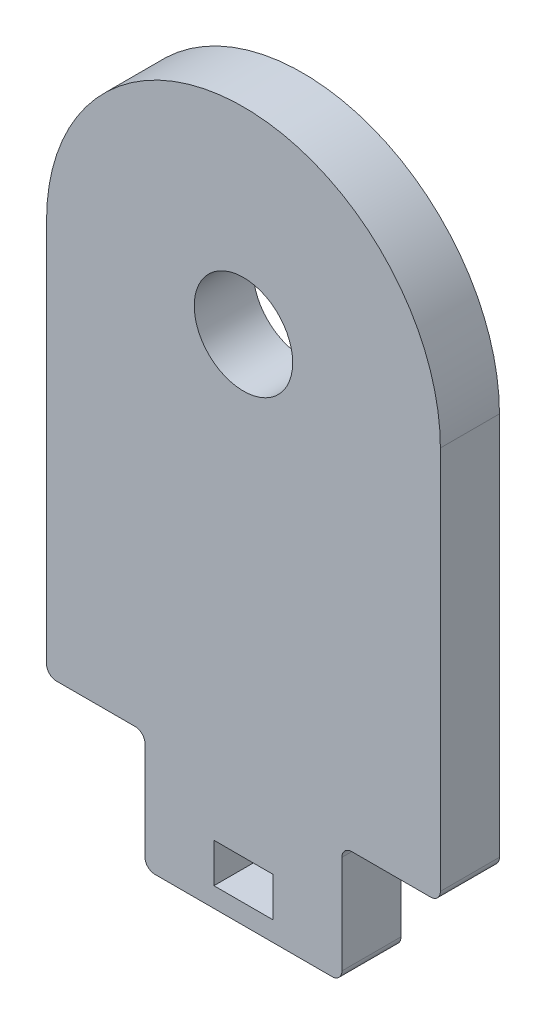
ISO-10303-21;
HEADER;
FILE_DESCRIPTION(('STEP AP214'),'2;1');
FILE_NAME('part.step','',(''),(''),'','','');
FILE_SCHEMA(('AUTOMOTIVE_DESIGN { 1 0 10303 214 1 1 1 1 }'));
ENDSEC;
DATA;
#1=APPLICATION_CONTEXT('core data for automotive mechanical design processes');
#2=APPLICATION_PROTOCOL_DEFINITION('international standard','automotive_design',2000,#1);
#3=PRODUCT_CONTEXT('',#1,'mechanical');
#4=PRODUCT('Part','Part','',(#3));
#5=PRODUCT_RELATED_PRODUCT_CATEGORY('part','',(#4));
#6=PRODUCT_DEFINITION_FORMATION('','',#4);
#7=PRODUCT_DEFINITION_CONTEXT('part definition',#1,'design');
#8=PRODUCT_DEFINITION('design','',#6,#7);
#9=PRODUCT_DEFINITION_SHAPE('','',#8);
#10=(LENGTH_UNIT() NAMED_UNIT(*) SI_UNIT(.MILLI.,.METRE.));
#11=(NAMED_UNIT(*) PLANE_ANGLE_UNIT() SI_UNIT($,.RADIAN.));
#12=(NAMED_UNIT(*) SI_UNIT($,.STERADIAN.) SOLID_ANGLE_UNIT());
#13=UNCERTAINTY_MEASURE_WITH_UNIT(LENGTH_MEASURE(1.E-05),#10,'distance_accuracy_value','');
#14=(GEOMETRIC_REPRESENTATION_CONTEXT(3) GLOBAL_UNCERTAINTY_ASSIGNED_CONTEXT((#13)) GLOBAL_UNIT_ASSIGNED_CONTEXT((#10,
#11,#12)) REPRESENTATION_CONTEXT('',''));
#15=CARTESIAN_POINT('',(0.,0.,0.));
#16=DIRECTION('',(0.,0.,1.));
#17=DIRECTION('',(1.,0.,0.));
#18=AXIS2_PLACEMENT_3D('',#15,#16,#17);
#19=CARTESIAN_POINT('',(0.,52.,6.));
#20=DIRECTION('',(0.,0.,-1.));
#21=DIRECTION('',(-1.,0.,0.));
#22=AXIS2_PLACEMENT_3D('',#19,#20,#21);
#23=PLANE('',#22);
#24=CARTESIAN_POINT('',(0.,52.,6.));
#25=DIRECTION('',(0.,0.,1.));
#26=DIRECTION('',(1.,0.,0.));
#27=AXIS2_PLACEMENT_3D('',#24,#25,#26);
#28=CIRCLE('',#27,5.);
#29=CARTESIAN_POINT('',(5.,52.,6.));
#30=VERTEX_POINT('',#29);
#31=EDGE_CURVE('E545',#30,#30,#28,.T.);
#32=ORIENTED_EDGE('',*,*,#31,.F.);
#33=EDGE_LOOP('',(#32));
#34=FACE_BOUND('',#33,.T.);
#35=DIRECTION('',(0.,-1.,0.));
#36=VECTOR('',#35,1.);
#37=CARTESIAN_POINT('',(-20.,12.,6.));
#38=LINE('',#37,#36);
#39=CARTESIAN_POINT('',(-20.,52.,6.));
#40=VERTEX_POINT('',#39);
#41=CARTESIAN_POINT('',(-20.,13.,6.));
#42=VERTEX_POINT('',#41);
#43=EDGE_CURVE('E220',#40,#42,#38,.T.);
#44=ORIENTED_EDGE('',*,*,#43,.T.);
#45=CARTESIAN_POINT('',(-19.,13.,6.));
#46=DIRECTION('',(0.,0.,-1.));
#47=DIRECTION('',(-1.,0.,0.));
#48=AXIS2_PLACEMENT_3D('',#45,#46,#47);
#49=CIRCLE('',#48,1.);
#50=CARTESIAN_POINT('',(-19.,12.,6.));
#51=VERTEX_POINT('',#50);
#52=EDGE_CURVE('E275',#42,#51,#49,.F.);
#53=ORIENTED_EDGE('',*,*,#52,.T.);
#54=DIRECTION('',(1.,0.,0.));
#55=VECTOR('',#54,1.);
#56=CARTESIAN_POINT('',(-10.,12.,6.));
#57=LINE('',#56,#55);
#58=CARTESIAN_POINT('',(-11.,12.,6.));
#59=VERTEX_POINT('',#58);
#60=EDGE_CURVE('E223',#51,#59,#57,.T.);
#61=ORIENTED_EDGE('',*,*,#60,.T.);
#62=CARTESIAN_POINT('',(-11.,11.,6.));
#63=DIRECTION('',(0.,0.,-1.));
#64=DIRECTION('',(-1.,0.,0.));
#65=AXIS2_PLACEMENT_3D('',#62,#63,#64);
#66=CIRCLE('',#65,1.);
#67=CARTESIAN_POINT('',(-10.,11.,6.));
#68=VERTEX_POINT('',#67);
#69=EDGE_CURVE('E301',#59,#68,#66,.T.);
#70=ORIENTED_EDGE('',*,*,#69,.T.);
#71=DIRECTION('',(0.,-1.,0.));
#72=VECTOR('',#71,1.);
#73=CARTESIAN_POINT('',(-10.,0.,6.));
#74=LINE('',#73,#72);
#75=CARTESIAN_POINT('',(-10.,1.,6.));
#76=VERTEX_POINT('',#75);
#77=EDGE_CURVE('E226',#68,#76,#74,.T.);
#78=ORIENTED_EDGE('',*,*,#77,.T.);
#79=CARTESIAN_POINT('',(-9.,1.,6.));
#80=DIRECTION('',(0.,0.,-1.));
#81=DIRECTION('',(-1.,0.,0.));
#82=AXIS2_PLACEMENT_3D('',#79,#80,#81);
#83=CIRCLE('',#82,1.);
#84=CARTESIAN_POINT('',(-9.,0.,6.));
#85=VERTEX_POINT('',#84);
#86=EDGE_CURVE('E61',#76,#85,#83,.F.);
#87=ORIENTED_EDGE('',*,*,#86,.T.);
#88=DIRECTION('',(1.,0.,0.));
#89=VECTOR('',#88,1.);
#90=CARTESIAN_POINT('',(-10.,0.,6.));
#91=LINE('',#90,#89);
#92=CARTESIAN_POINT('',(9.,0.,6.));
#93=VERTEX_POINT('',#92);
#94=EDGE_CURVE('E228',#85,#93,#91,.T.);
#95=ORIENTED_EDGE('',*,*,#94,.T.);
#96=CARTESIAN_POINT('',(9.,1.,6.));
#97=DIRECTION('',(0.,0.,-1.));
#98=DIRECTION('',(-1.,0.,0.));
#99=AXIS2_PLACEMENT_3D('',#96,#97,#98);
#100=CIRCLE('',#99,1.);
#101=CARTESIAN_POINT('',(10.,1.,6.));
#102=VERTEX_POINT('',#101);
#103=EDGE_CURVE('E270',#93,#102,#100,.F.);
#104=ORIENTED_EDGE('',*,*,#103,.T.);
#105=DIRECTION('',(0.,1.,0.));
#106=VECTOR('',#105,1.);
#107=CARTESIAN_POINT('',(10.,0.,6.));
#108=LINE('',#107,#106);
#109=CARTESIAN_POINT('',(10.,11.,6.));
#110=VERTEX_POINT('',#109);
#111=EDGE_CURVE('E209',#102,#110,#108,.T.);
#112=ORIENTED_EDGE('',*,*,#111,.T.);
#113=CARTESIAN_POINT('',(11.,11.,6.));
#114=DIRECTION('',(0.,0.,-1.));
#115=DIRECTION('',(-1.,0.,0.));
#116=AXIS2_PLACEMENT_3D('',#113,#114,#115);
#117=CIRCLE('',#116,1.);
#118=CARTESIAN_POINT('',(11.,12.,6.));
#119=VERTEX_POINT('',#118);
#120=EDGE_CURVE('E11',#110,#119,#117,.T.);
#121=ORIENTED_EDGE('',*,*,#120,.T.);
#122=DIRECTION('',(1.,0.,0.));
#123=VECTOR('',#122,1.);
#124=CARTESIAN_POINT('',(10.,12.,6.));
#125=LINE('',#124,#123);
#126=CARTESIAN_POINT('',(19.,12.,6.));
#127=VERTEX_POINT('',#126);
#128=EDGE_CURVE('E212',#119,#127,#125,.T.);
#129=ORIENTED_EDGE('',*,*,#128,.T.);
#130=CARTESIAN_POINT('',(19.,13.,6.));
#131=DIRECTION('',(0.,0.,-1.));
#132=DIRECTION('',(-1.,0.,0.));
#133=AXIS2_PLACEMENT_3D('',#130,#131,#132);
#134=CIRCLE('',#133,1.);
#135=CARTESIAN_POINT('',(20.,13.,6.));
#136=VERTEX_POINT('',#135);
#137=EDGE_CURVE('E272',#127,#136,#134,.F.);
#138=ORIENTED_EDGE('',*,*,#137,.T.);
#139=DIRECTION('',(0.,1.,0.));
#140=VECTOR('',#139,1.);
#141=CARTESIAN_POINT('',(20.,12.,6.));
#142=LINE('',#141,#140);
#143=CARTESIAN_POINT('',(20.,52.,6.));
#144=VERTEX_POINT('',#143);
#145=EDGE_CURVE('E216',#136,#144,#142,.T.);
#146=ORIENTED_EDGE('',*,*,#145,.T.);
#147=CARTESIAN_POINT('',(0.,52.,6.));
#148=DIRECTION('',(0.,0.,1.));
#149=DIRECTION('',(-1.,0.,0.));
#150=AXIS2_PLACEMENT_3D('',#147,#148,#149);
#151=CIRCLE('',#150,20.);
#152=EDGE_CURVE('E218',#144,#40,#151,.T.);
#153=ORIENTED_EDGE('',*,*,#152,.T.);
#154=EDGE_LOOP('',(#44,#53,#61,#70,#78,#87,#95,#104,#112,#121,#129,#138,#146,#153));
#155=FACE_BOUND('',#154,.T.);
#156=DIRECTION('',(0.,1.,0.));
#157=VECTOR('',#156,1.);
#158=CARTESIAN_POINT('',(3.,6.,6.));
#159=LINE('',#158,#157);
#160=CARTESIAN_POINT('',(3.,2.,6.));
#161=VERTEX_POINT('',#160);
#162=CARTESIAN_POINT('',(3.,6.,6.));
#163=VERTEX_POINT('',#162);
#164=EDGE_CURVE('E166',#161,#163,#159,.T.);
#165=ORIENTED_EDGE('',*,*,#164,.F.);
#166=DIRECTION('',(1.,0.,0.));
#167=VECTOR('',#166,1.);
#168=CARTESIAN_POINT('',(-3.,2.,6.));
#169=LINE('',#168,#167);
#170=CARTESIAN_POINT('',(-3.,2.,6.));
#171=VERTEX_POINT('',#170);
#172=EDGE_CURVE('E191',#171,#161,#169,.T.);
#173=ORIENTED_EDGE('',*,*,#172,.F.);
#174=DIRECTION('',(0.,-1.,0.));
#175=VECTOR('',#174,1.);
#176=CARTESIAN_POINT('',(-3.,6.,6.));
#177=LINE('',#176,#175);
#178=CARTESIAN_POINT('',(-3.,6.,6.));
#179=VERTEX_POINT('',#178);
#180=EDGE_CURVE('E189',#179,#171,#177,.T.);
#181=ORIENTED_EDGE('',*,*,#180,.F.);
#182=DIRECTION('',(-1.,0.,0.));
#183=VECTOR('',#182,1.);
#184=CARTESIAN_POINT('',(-3.,6.,6.));
#185=LINE('',#184,#183);
#186=EDGE_CURVE('E176',#163,#179,#185,.T.);
#187=ORIENTED_EDGE('',*,*,#186,.F.);
#188=EDGE_LOOP('',(#165,#173,#181,#187));
#189=FACE_BOUND('',#188,.T.);
#190=ADVANCED_FACE('F39',(#34,#155,#189),#23,.F.);
#191=CARTESIAN_POINT('',(0.,52.,0.));
#192=DIRECTION('',(0.,0.,-1.));
#193=DIRECTION('',(-1.,0.,0.));
#194=AXIS2_PLACEMENT_3D('',#191,#192,#193);
#195=PLANE('',#194);
#196=CARTESIAN_POINT('',(0.,52.,0.));
#197=DIRECTION('',(0.,0.,1.));
#198=DIRECTION('',(1.,0.,0.));
#199=AXIS2_PLACEMENT_3D('',#196,#197,#198);
#200=CIRCLE('',#199,5.);
#201=CARTESIAN_POINT('',(5.,52.,0.));
#202=VERTEX_POINT('',#201);
#203=EDGE_CURVE('E198',#202,#202,#200,.T.);
#204=ORIENTED_EDGE('',*,*,#203,.T.);
#205=EDGE_LOOP('',(#204));
#206=FACE_BOUND('',#205,.T.);
#207=DIRECTION('',(1.,0.,0.));
#208=VECTOR('',#207,1.);
#209=CARTESIAN_POINT('',(-10.,12.,0.));
#210=LINE('',#209,#208);
#211=CARTESIAN_POINT('',(-19.,12.,0.));
#212=VERTEX_POINT('',#211);
#213=CARTESIAN_POINT('',(-11.,12.,0.));
#214=VERTEX_POINT('',#213);
#215=EDGE_CURVE('E243',#212,#214,#210,.T.);
#216=ORIENTED_EDGE('',*,*,#215,.F.);
#217=CARTESIAN_POINT('',(-19.,13.,0.));
#218=DIRECTION('',(0.,0.,-1.));
#219=DIRECTION('',(-1.,0.,0.));
#220=AXIS2_PLACEMENT_3D('',#217,#218,#219);
#221=CIRCLE('',#220,1.);
#222=CARTESIAN_POINT('',(-20.,13.,0.));
#223=VERTEX_POINT('',#222);
#224=EDGE_CURVE('E266',#212,#223,#221,.T.);
#225=ORIENTED_EDGE('',*,*,#224,.T.);
#226=DIRECTION('',(0.,-1.,0.));
#227=VECTOR('',#226,1.);
#228=CARTESIAN_POINT('',(-20.,12.,0.));
#229=LINE('',#228,#227);
#230=CARTESIAN_POINT('',(-20.,52.,0.));
#231=VERTEX_POINT('',#230);
#232=EDGE_CURVE('E240',#231,#223,#229,.T.);
#233=ORIENTED_EDGE('',*,*,#232,.F.);
#234=CARTESIAN_POINT('',(0.,52.,0.));
#235=DIRECTION('',(0.,0.,1.));
#236=DIRECTION('',(-1.,0.,0.));
#237=AXIS2_PLACEMENT_3D('',#234,#235,#236);
#238=CIRCLE('',#237,20.);
#239=CARTESIAN_POINT('',(20.,52.,0.));
#240=VERTEX_POINT('',#239);
#241=EDGE_CURVE('E238',#240,#231,#238,.T.);
#242=ORIENTED_EDGE('',*,*,#241,.F.);
#243=DIRECTION('',(0.,1.,0.));
#244=VECTOR('',#243,1.);
#245=CARTESIAN_POINT('',(20.,12.,0.));
#246=LINE('',#245,#244);
#247=CARTESIAN_POINT('',(20.,13.,0.));
#248=VERTEX_POINT('',#247);
#249=EDGE_CURVE('E236',#248,#240,#246,.T.);
#250=ORIENTED_EDGE('',*,*,#249,.F.);
#251=CARTESIAN_POINT('',(19.,13.,0.));
#252=DIRECTION('',(0.,0.,-1.));
#253=DIRECTION('',(-1.,0.,0.));
#254=AXIS2_PLACEMENT_3D('',#251,#252,#253);
#255=CIRCLE('',#254,1.);
#256=CARTESIAN_POINT('',(19.,12.,0.));
#257=VERTEX_POINT('',#256);
#258=EDGE_CURVE('E262',#248,#257,#255,.T.);
#259=ORIENTED_EDGE('',*,*,#258,.T.);
#260=DIRECTION('',(1.,0.,0.));
#261=VECTOR('',#260,1.);
#262=CARTESIAN_POINT('',(10.,12.,0.));
#263=LINE('',#262,#261);
#264=CARTESIAN_POINT('',(11.,12.,0.));
#265=VERTEX_POINT('',#264);
#266=EDGE_CURVE('E233',#265,#257,#263,.T.);
#267=ORIENTED_EDGE('',*,*,#266,.F.);
#268=CARTESIAN_POINT('',(11.,11.,0.));
#269=DIRECTION('',(0.,0.,-1.));
#270=DIRECTION('',(-1.,0.,0.));
#271=AXIS2_PLACEMENT_3D('',#268,#269,#270);
#272=CIRCLE('',#271,1.);
#273=CARTESIAN_POINT('',(10.,11.,0.));
#274=VERTEX_POINT('',#273);
#275=EDGE_CURVE('E47',#265,#274,#272,.F.);
#276=ORIENTED_EDGE('',*,*,#275,.T.);
#277=DIRECTION('',(0.,1.,0.));
#278=VECTOR('',#277,1.);
#279=CARTESIAN_POINT('',(10.,0.,0.));
#280=LINE('',#279,#278);
#281=CARTESIAN_POINT('',(10.,1.,0.));
#282=VERTEX_POINT('',#281);
#283=EDGE_CURVE('E184',#282,#274,#280,.T.);
#284=ORIENTED_EDGE('',*,*,#283,.F.);
#285=CARTESIAN_POINT('',(9.,1.,0.));
#286=DIRECTION('',(0.,0.,-1.));
#287=DIRECTION('',(-1.,0.,0.));
#288=AXIS2_PLACEMENT_3D('',#285,#286,#287);
#289=CIRCLE('',#288,1.);
#290=CARTESIAN_POINT('',(9.,0.,0.));
#291=VERTEX_POINT('',#290);
#292=EDGE_CURVE('E260',#282,#291,#289,.T.);
#293=ORIENTED_EDGE('',*,*,#292,.T.);
#294=DIRECTION('',(1.,0.,0.));
#295=VECTOR('',#294,1.);
#296=CARTESIAN_POINT('',(-10.,0.,0.));
#297=LINE('',#296,#295);
#298=CARTESIAN_POINT('',(-9.,0.,0.));
#299=VERTEX_POINT('',#298);
#300=EDGE_CURVE('E213',#299,#291,#297,.T.);
#301=ORIENTED_EDGE('',*,*,#300,.F.);
#302=CARTESIAN_POINT('',(-9.,1.,0.));
#303=DIRECTION('',(0.,0.,-1.));
#304=DIRECTION('',(-1.,0.,0.));
#305=AXIS2_PLACEMENT_3D('',#302,#303,#304);
#306=CIRCLE('',#305,1.);
#307=CARTESIAN_POINT('',(-10.,1.,0.));
#308=VERTEX_POINT('',#307);
#309=EDGE_CURVE('E264',#299,#308,#306,.T.);
#310=ORIENTED_EDGE('',*,*,#309,.T.);
#311=DIRECTION('',(0.,-1.,0.));
#312=VECTOR('',#311,1.);
#313=CARTESIAN_POINT('',(-10.,0.,0.));
#314=LINE('',#313,#312);
#315=CARTESIAN_POINT('',(-10.,11.,0.));
#316=VERTEX_POINT('',#315);
#317=EDGE_CURVE('E246',#316,#308,#314,.T.);
#318=ORIENTED_EDGE('',*,*,#317,.F.);
#319=CARTESIAN_POINT('',(-11.,11.,0.));
#320=DIRECTION('',(0.,0.,-1.));
#321=DIRECTION('',(-1.,0.,0.));
#322=AXIS2_PLACEMENT_3D('',#319,#320,#321);
#323=CIRCLE('',#322,1.);
#324=EDGE_CURVE('E299',#316,#214,#323,.F.);
#325=ORIENTED_EDGE('',*,*,#324,.T.);
#326=EDGE_LOOP('',(#216,#225,#233,#242,#250,#259,#267,#276,#284,#293,#301,#310,#318,#325));
#327=FACE_BOUND('',#326,.T.);
#328=DIRECTION('',(1.,0.,0.));
#329=VECTOR('',#328,1.);
#330=CARTESIAN_POINT('',(-3.,2.,0.));
#331=LINE('',#330,#329);
#332=CARTESIAN_POINT('',(-3.,2.,0.));
#333=VERTEX_POINT('',#332);
#334=CARTESIAN_POINT('',(3.,2.,0.));
#335=VERTEX_POINT('',#334);
#336=EDGE_CURVE('E177',#333,#335,#331,.T.);
#337=ORIENTED_EDGE('',*,*,#336,.T.);
#338=DIRECTION('',(0.,1.,0.));
#339=VECTOR('',#338,1.);
#340=CARTESIAN_POINT('',(3.,6.,0.));
#341=LINE('',#340,#339);
#342=CARTESIAN_POINT('',(3.,6.,0.));
#343=VERTEX_POINT('',#342);
#344=EDGE_CURVE('E196',#335,#343,#341,.T.);
#345=ORIENTED_EDGE('',*,*,#344,.T.);
#346=DIRECTION('',(-1.,0.,0.));
#347=VECTOR('',#346,1.);
#348=CARTESIAN_POINT('',(-3.,6.,0.));
#349=LINE('',#348,#347);
#350=CARTESIAN_POINT('',(-3.,6.,0.));
#351=VERTEX_POINT('',#350);
#352=EDGE_CURVE('E183',#343,#351,#349,.T.);
#353=ORIENTED_EDGE('',*,*,#352,.T.);
#354=DIRECTION('',(0.,-1.,0.));
#355=VECTOR('',#354,1.);
#356=CARTESIAN_POINT('',(-3.,6.,0.));
#357=LINE('',#356,#355);
#358=EDGE_CURVE('E200',#351,#333,#357,.T.);
#359=ORIENTED_EDGE('',*,*,#358,.T.);
#360=EDGE_LOOP('',(#337,#345,#353,#359));
#361=FACE_BOUND('',#360,.T.);
#362=ADVANCED_FACE('F306',(#206,#327,#361),#195,.T.);
#363=CARTESIAN_POINT('',(10.,0.,6.));
#364=DIRECTION('',(-1.,0.,0.));
#365=DIRECTION('',(0.,0.,1.));
#366=AXIS2_PLACEMENT_3D('',#363,#364,#365);
#367=PLANE('',#366);
#368=ORIENTED_EDGE('',*,*,#111,.F.);
#369=DIRECTION('',(0.,0.,-1.));
#370=VECTOR('',#369,1.);
#371=CARTESIAN_POINT('',(10.,1.,6.));
#372=LINE('',#371,#370);
#373=EDGE_CURVE('E296',#102,#282,#372,.T.);
#374=ORIENTED_EDGE('',*,*,#373,.T.);
#375=ORIENTED_EDGE('',*,*,#283,.T.);
#376=DIRECTION('',(0.,0.,-1.));
#377=VECTOR('',#376,1.);
#378=CARTESIAN_POINT('',(10.,11.,6.));
#379=LINE('',#378,#377);
#380=EDGE_CURVE('E294',#274,#110,#379,.F.);
#381=ORIENTED_EDGE('',*,*,#380,.T.);
#382=EDGE_LOOP('',(#368,#374,#375,#381));
#383=FACE_BOUND('',#382,.T.);
#384=ADVANCED_FACE('F313',(#383),#367,.F.);
#385=CARTESIAN_POINT('',(10.,12.,6.));
#386=DIRECTION('',(0.,1.,0.));
#387=DIRECTION('',(-1.,0.,0.));
#388=AXIS2_PLACEMENT_3D('',#385,#386,#387);
#389=PLANE('',#388);
#390=ORIENTED_EDGE('',*,*,#266,.T.);
#391=DIRECTION('',(0.,0.,-1.));
#392=VECTOR('',#391,1.);
#393=CARTESIAN_POINT('',(19.,12.,6.));
#394=LINE('',#393,#392);
#395=EDGE_CURVE('E292',#257,#127,#394,.F.);
#396=ORIENTED_EDGE('',*,*,#395,.T.);
#397=ORIENTED_EDGE('',*,*,#128,.F.);
#398=DIRECTION('',(0.,0.,-1.));
#399=VECTOR('',#398,1.);
#400=CARTESIAN_POINT('',(11.,12.,0.));
#401=LINE('',#400,#399);
#402=EDGE_CURVE('E289',#119,#265,#401,.T.);
#403=ORIENTED_EDGE('',*,*,#402,.T.);
#404=EDGE_LOOP('',(#390,#396,#397,#403));
#405=FACE_BOUND('',#404,.T.);
#406=ADVANCED_FACE('F319',(#405),#389,.F.);
#407=CARTESIAN_POINT('',(20.,12.,6.));
#408=DIRECTION('',(-1.,0.,0.));
#409=DIRECTION('',(0.,0.,1.));
#410=AXIS2_PLACEMENT_3D('',#407,#408,#409);
#411=PLANE('',#410);
#412=ORIENTED_EDGE('',*,*,#145,.F.);
#413=DIRECTION('',(0.,0.,-1.));
#414=VECTOR('',#413,1.);
#415=CARTESIAN_POINT('',(20.,13.,6.));
#416=LINE('',#415,#414);
#417=EDGE_CURVE('E286',#136,#248,#416,.T.);
#418=ORIENTED_EDGE('',*,*,#417,.T.);
#419=ORIENTED_EDGE('',*,*,#249,.T.);
#420=DIRECTION('',(0.,0.,-1.));
#421=VECTOR('',#420,1.);
#422=CARTESIAN_POINT('',(20.,52.,6.));
#423=LINE('',#422,#421);
#424=EDGE_CURVE('E252',#144,#240,#423,.T.);
#425=ORIENTED_EDGE('',*,*,#424,.F.);
#426=EDGE_LOOP('',(#412,#418,#419,#425));
#427=FACE_BOUND('',#426,.T.);
#428=ADVANCED_FACE('F327',(#427),#411,.F.);
#429=CARTESIAN_POINT('',(0.,52.,6.));
#430=DIRECTION('',(0.,0.,-1.));
#431=DIRECTION('',(-1.,0.,0.));
#432=AXIS2_PLACEMENT_3D('',#429,#430,#431);
#433=CYLINDRICAL_SURFACE('',#432,20.);
#434=ORIENTED_EDGE('',*,*,#241,.T.);
#435=DIRECTION('',(0.,0.,-1.));
#436=VECTOR('',#435,1.);
#437=CARTESIAN_POINT('',(-20.,52.,6.));
#438=LINE('',#437,#436);
#439=EDGE_CURVE('E230',#40,#231,#438,.T.);
#440=ORIENTED_EDGE('',*,*,#439,.F.);
#441=ORIENTED_EDGE('',*,*,#152,.F.);
#442=ORIENTED_EDGE('',*,*,#424,.T.);
#443=EDGE_LOOP('',(#434,#440,#441,#442));
#444=FACE_BOUND('',#443,.T.);
#445=ADVANCED_FACE('F333',(#444),#433,.T.);
#446=CARTESIAN_POINT('',(-20.,12.,6.));
#447=DIRECTION('',(1.,0.,0.));
#448=DIRECTION('',(0.,0.,-1.));
#449=AXIS2_PLACEMENT_3D('',#446,#447,#448);
#450=PLANE('',#449);
#451=ORIENTED_EDGE('',*,*,#232,.T.);
#452=DIRECTION('',(0.,0.,-1.));
#453=VECTOR('',#452,1.);
#454=CARTESIAN_POINT('',(-20.,13.,6.));
#455=LINE('',#454,#453);
#456=EDGE_CURVE('E268',#223,#42,#455,.F.);
#457=ORIENTED_EDGE('',*,*,#456,.T.);
#458=ORIENTED_EDGE('',*,*,#43,.F.);
#459=ORIENTED_EDGE('',*,*,#439,.T.);
#460=EDGE_LOOP('',(#451,#457,#458,#459));
#461=FACE_BOUND('',#460,.T.);
#462=ADVANCED_FACE('F388',(#461),#450,.F.);
#463=CARTESIAN_POINT('',(-10.,12.,6.));
#464=DIRECTION('',(0.,1.,0.));
#465=DIRECTION('',(-1.,0.,0.));
#466=AXIS2_PLACEMENT_3D('',#463,#464,#465);
#467=PLANE('',#466);
#468=ORIENTED_EDGE('',*,*,#60,.F.);
#469=DIRECTION('',(0.,0.,-1.));
#470=VECTOR('',#469,1.);
#471=CARTESIAN_POINT('',(-19.,12.,6.));
#472=LINE('',#471,#470);
#473=EDGE_CURVE('E257',#51,#212,#472,.T.);
#474=ORIENTED_EDGE('',*,*,#473,.T.);
#475=ORIENTED_EDGE('',*,*,#215,.T.);
#476=DIRECTION('',(0.,0.,-1.));
#477=VECTOR('',#476,1.);
#478=CARTESIAN_POINT('',(-11.,12.,6.));
#479=LINE('',#478,#477);
#480=EDGE_CURVE('E255',#214,#59,#479,.F.);
#481=ORIENTED_EDGE('',*,*,#480,.T.);
#482=EDGE_LOOP('',(#468,#474,#475,#481));
#483=FACE_BOUND('',#482,.T.);
#484=ADVANCED_FACE('F343',(#483),#467,.F.);
#485=CARTESIAN_POINT('',(-10.,0.,6.));
#486=DIRECTION('',(1.,0.,0.));
#487=DIRECTION('',(0.,0.,-1.));
#488=AXIS2_PLACEMENT_3D('',#485,#486,#487);
#489=PLANE('',#488);
#490=ORIENTED_EDGE('',*,*,#77,.F.);
#491=DIRECTION('',(0.,0.,-1.));
#492=VECTOR('',#491,1.);
#493=CARTESIAN_POINT('',(-10.,11.,0.));
#494=LINE('',#493,#492);
#495=EDGE_CURVE('E279',#68,#316,#494,.T.);
#496=ORIENTED_EDGE('',*,*,#495,.T.);
#497=ORIENTED_EDGE('',*,*,#317,.T.);
#498=DIRECTION('',(0.,0.,-1.));
#499=VECTOR('',#498,1.);
#500=CARTESIAN_POINT('',(-10.,1.,6.));
#501=LINE('',#500,#499);
#502=EDGE_CURVE('E277',#308,#76,#501,.F.);
#503=ORIENTED_EDGE('',*,*,#502,.T.);
#504=EDGE_LOOP('',(#490,#496,#497,#503));
#505=FACE_BOUND('',#504,.T.);
#506=ADVANCED_FACE('F353',(#505),#489,.F.);
#507=CARTESIAN_POINT('',(-10.,0.,6.));
#508=DIRECTION('',(0.,1.,0.));
#509=DIRECTION('',(0.,0.,1.));
#510=AXIS2_PLACEMENT_3D('',#507,#508,#509);
#511=PLANE('',#510);
#512=ORIENTED_EDGE('',*,*,#94,.F.);
#513=DIRECTION('',(0.,0.,-1.));
#514=VECTOR('',#513,1.);
#515=CARTESIAN_POINT('',(-9.,0.,6.));
#516=LINE('',#515,#514);
#517=EDGE_CURVE('E283',#85,#299,#516,.T.);
#518=ORIENTED_EDGE('',*,*,#517,.T.);
#519=ORIENTED_EDGE('',*,*,#300,.T.);
#520=DIRECTION('',(0.,0.,-1.));
#521=VECTOR('',#520,1.);
#522=CARTESIAN_POINT('',(9.,0.,6.));
#523=LINE('',#522,#521);
#524=EDGE_CURVE('E54',#291,#93,#523,.F.);
#525=ORIENTED_EDGE('',*,*,#524,.T.);
#526=EDGE_LOOP('',(#512,#518,#519,#525));
#527=FACE_BOUND('',#526,.T.);
#528=ADVANCED_FACE('F359',(#527),#511,.F.);
#529=CARTESIAN_POINT('',(3.,6.,6.));
#530=DIRECTION('',(-1.,0.,0.));
#531=DIRECTION('',(0.,-1.,0.));
#532=AXIS2_PLACEMENT_3D('',#529,#530,#531);
#533=PLANE('',#532);
#534=ORIENTED_EDGE('',*,*,#344,.F.);
#535=DIRECTION('',(0.,0.,-1.));
#536=VECTOR('',#535,1.);
#537=CARTESIAN_POINT('',(3.,2.,6.));
#538=LINE('',#537,#536);
#539=EDGE_CURVE('E172',#161,#335,#538,.T.);
#540=ORIENTED_EDGE('',*,*,#539,.F.);
#541=ORIENTED_EDGE('',*,*,#164,.T.);
#542=DIRECTION('',(0.,0.,-1.));
#543=VECTOR('',#542,1.);
#544=CARTESIAN_POINT('',(3.,6.,6.));
#545=LINE('',#544,#543);
#546=EDGE_CURVE('E169',#163,#343,#545,.T.);
#547=ORIENTED_EDGE('',*,*,#546,.T.);
#548=EDGE_LOOP('',(#534,#540,#541,#547));
#549=FACE_BOUND('',#548,.T.);
#550=ADVANCED_FACE('F168',(#549),#533,.T.);
#551=CARTESIAN_POINT('',(-3.,6.,6.));
#552=DIRECTION('',(0.,-1.,0.));
#553=DIRECTION('',(0.,0.,-1.));
#554=AXIS2_PLACEMENT_3D('',#551,#552,#553);
#555=PLANE('',#554);
#556=ORIENTED_EDGE('',*,*,#352,.F.);
#557=ORIENTED_EDGE('',*,*,#546,.F.);
#558=ORIENTED_EDGE('',*,*,#186,.T.);
#559=DIRECTION('',(0.,0.,-1.));
#560=VECTOR('',#559,1.);
#561=CARTESIAN_POINT('',(-3.,6.,6.));
#562=LINE('',#561,#560);
#563=EDGE_CURVE('E185',#179,#351,#562,.T.);
#564=ORIENTED_EDGE('',*,*,#563,.T.);
#565=EDGE_LOOP('',(#556,#557,#558,#564));
#566=FACE_BOUND('',#565,.T.);
#567=ADVANCED_FACE('F180',(#566),#555,.T.);
#568=CARTESIAN_POINT('',(-3.,6.,6.));
#569=DIRECTION('',(1.,0.,0.));
#570=DIRECTION('',(0.,1.,0.));
#571=AXIS2_PLACEMENT_3D('',#568,#569,#570);
#572=PLANE('',#571);
#573=ORIENTED_EDGE('',*,*,#358,.F.);
#574=ORIENTED_EDGE('',*,*,#563,.F.);
#575=ORIENTED_EDGE('',*,*,#180,.T.);
#576=DIRECTION('',(0.,0.,-1.));
#577=VECTOR('',#576,1.);
#578=CARTESIAN_POINT('',(-3.,2.,6.));
#579=LINE('',#578,#577);
#580=EDGE_CURVE('E206',#171,#333,#579,.T.);
#581=ORIENTED_EDGE('',*,*,#580,.T.);
#582=EDGE_LOOP('',(#573,#574,#575,#581));
#583=FACE_BOUND('',#582,.T.);
#584=ADVANCED_FACE('F508',(#583),#572,.T.);
#585=CARTESIAN_POINT('',(-3.,2.,6.));
#586=DIRECTION('',(0.,1.,0.));
#587=DIRECTION('',(0.,0.,1.));
#588=AXIS2_PLACEMENT_3D('',#585,#586,#587);
#589=PLANE('',#588);
#590=ORIENTED_EDGE('',*,*,#336,.F.);
#591=ORIENTED_EDGE('',*,*,#580,.F.);
#592=ORIENTED_EDGE('',*,*,#172,.T.);
#593=ORIENTED_EDGE('',*,*,#539,.T.);
#594=EDGE_LOOP('',(#590,#591,#592,#593));
#595=FACE_BOUND('',#594,.T.);
#596=ADVANCED_FACE('F401',(#595),#589,.T.);
#597=CARTESIAN_POINT('',(-19.,13.,6.));
#598=DIRECTION('',(0.,0.,-1.));
#599=DIRECTION('',(-1.,0.,0.));
#600=AXIS2_PLACEMENT_3D('',#597,#598,#599);
#601=CYLINDRICAL_SURFACE('',#600,1.);
#602=ORIENTED_EDGE('',*,*,#52,.F.);
#603=ORIENTED_EDGE('',*,*,#456,.F.);
#604=ORIENTED_EDGE('',*,*,#224,.F.);
#605=ORIENTED_EDGE('',*,*,#473,.F.);
#606=EDGE_LOOP('',(#602,#603,#604,#605));
#607=FACE_BOUND('',#606,.T.);
#608=ADVANCED_FACE('F341',(#607),#601,.T.);
#609=CARTESIAN_POINT('',(-11.,11.,6.));
#610=DIRECTION('',(0.,0.,1.));
#611=DIRECTION('',(1.,0.,0.));
#612=AXIS2_PLACEMENT_3D('',#609,#610,#611);
#613=CYLINDRICAL_SURFACE('',#612,1.);
#614=ORIENTED_EDGE('',*,*,#69,.F.);
#615=ORIENTED_EDGE('',*,*,#480,.F.);
#616=ORIENTED_EDGE('',*,*,#324,.F.);
#617=ORIENTED_EDGE('',*,*,#495,.F.);
#618=EDGE_LOOP('',(#614,#615,#616,#617));
#619=FACE_BOUND('',#618,.T.);
#620=ADVANCED_FACE('F350',(#619),#613,.F.);
#621=CARTESIAN_POINT('',(-9.,1.,6.));
#622=DIRECTION('',(0.,0.,-1.));
#623=DIRECTION('',(-1.,0.,0.));
#624=AXIS2_PLACEMENT_3D('',#621,#622,#623);
#625=CYLINDRICAL_SURFACE('',#624,1.);
#626=ORIENTED_EDGE('',*,*,#86,.F.);
#627=ORIENTED_EDGE('',*,*,#502,.F.);
#628=ORIENTED_EDGE('',*,*,#309,.F.);
#629=ORIENTED_EDGE('',*,*,#517,.F.);
#630=EDGE_LOOP('',(#626,#627,#628,#629));
#631=FACE_BOUND('',#630,.T.);
#632=ADVANCED_FACE('F357',(#631),#625,.T.);
#633=CARTESIAN_POINT('',(19.,13.,6.));
#634=DIRECTION('',(0.,0.,-1.));
#635=DIRECTION('',(-1.,0.,0.));
#636=AXIS2_PLACEMENT_3D('',#633,#634,#635);
#637=CYLINDRICAL_SURFACE('',#636,1.);
#638=ORIENTED_EDGE('',*,*,#137,.F.);
#639=ORIENTED_EDGE('',*,*,#395,.F.);
#640=ORIENTED_EDGE('',*,*,#258,.F.);
#641=ORIENTED_EDGE('',*,*,#417,.F.);
#642=EDGE_LOOP('',(#638,#639,#640,#641));
#643=FACE_BOUND('',#642,.T.);
#644=ADVANCED_FACE('F322',(#643),#637,.T.);
#645=CARTESIAN_POINT('',(9.,1.,6.));
#646=DIRECTION('',(0.,0.,-1.));
#647=DIRECTION('',(-1.,0.,0.));
#648=AXIS2_PLACEMENT_3D('',#645,#646,#647);
#649=CYLINDRICAL_SURFACE('',#648,1.);
#650=ORIENTED_EDGE('',*,*,#103,.F.);
#651=ORIENTED_EDGE('',*,*,#524,.F.);
#652=ORIENTED_EDGE('',*,*,#292,.F.);
#653=ORIENTED_EDGE('',*,*,#373,.F.);
#654=EDGE_LOOP('',(#650,#651,#652,#653));
#655=FACE_BOUND('',#654,.T.);
#656=ADVANCED_FACE('F362',(#655),#649,.T.);
#657=CARTESIAN_POINT('',(11.,11.,6.));
#658=DIRECTION('',(0.,0.,1.));
#659=DIRECTION('',(1.,0.,0.));
#660=AXIS2_PLACEMENT_3D('',#657,#658,#659);
#661=CYLINDRICAL_SURFACE('',#660,1.);
#662=ORIENTED_EDGE('',*,*,#120,.F.);
#663=ORIENTED_EDGE('',*,*,#380,.F.);
#664=ORIENTED_EDGE('',*,*,#275,.F.);
#665=ORIENTED_EDGE('',*,*,#402,.F.);
#666=EDGE_LOOP('',(#662,#663,#664,#665));
#667=FACE_BOUND('',#666,.T.);
#668=ADVANCED_FACE('F41',(#667),#661,.F.);
#669=CARTESIAN_POINT('',(0.,52.,0.));
#670=DIRECTION('',(0.,0.,1.));
#671=DIRECTION('',(1.,0.,0.));
#672=AXIS2_PLACEMENT_3D('',#669,#670,#671);
#673=CYLINDRICAL_SURFACE('',#672,5.);
#674=ORIENTED_EDGE('',*,*,#203,.F.);
#675=EDGE_LOOP('',(#674));
#676=FACE_BOUND('',#675,.T.);
#677=ORIENTED_EDGE('',*,*,#31,.T.);
#678=EDGE_LOOP('',(#677));
#679=FACE_BOUND('',#678,.T.);
#680=ADVANCED_FACE('F368',(#676,#679),#673,.F.);
#681=CLOSED_SHELL('',(#190,#362,#384,#406,#428,#445,#462,#484,#506,#528,#550,#567,#584,#596,
#608,#620,#632,#644,#656,#668,#680));
#682=MANIFOLD_SOLID_BREP('B2',#681);
#683=ADVANCED_BREP_SHAPE_REPRESENTATION('',(#18,#682),#14);
#684=SHAPE_DEFINITION_REPRESENTATION(#9,#683);
ENDSEC;
END-ISO-10303-21;
